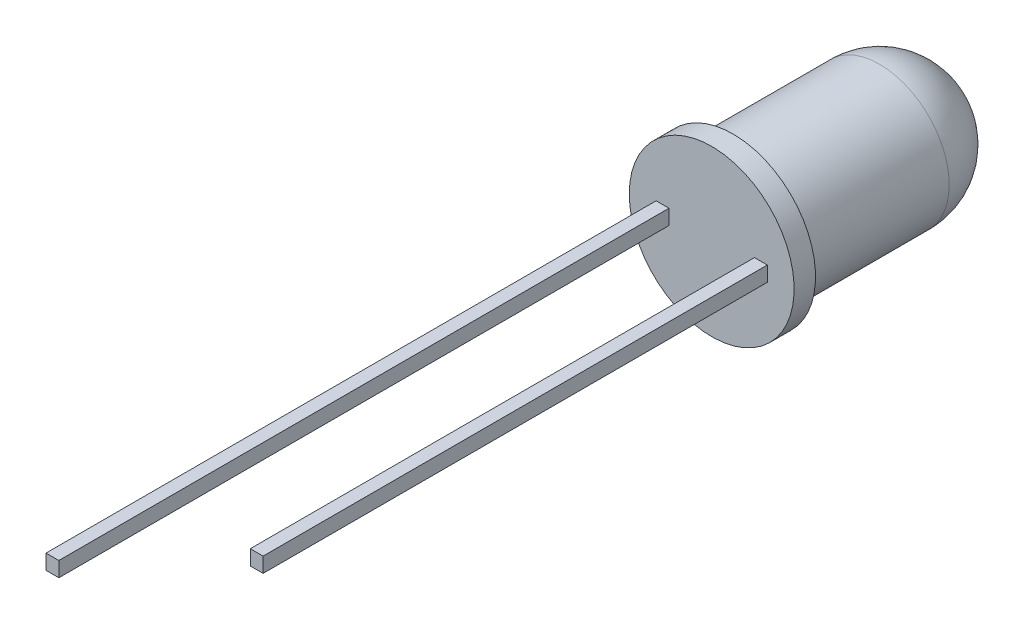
ISO-10303-21;
HEADER;
FILE_DESCRIPTION(('STEP AP214'),'2;1');
FILE_NAME('part.step','',(''),(''),'','','');
FILE_SCHEMA(('AUTOMOTIVE_DESIGN { 1 0 10303 214 1 1 1 1 }'));
ENDSEC;
DATA;
#1=APPLICATION_CONTEXT('core data for automotive mechanical design processes');
#2=APPLICATION_PROTOCOL_DEFINITION('international standard','automotive_design',2000,#1);
#3=PRODUCT_CONTEXT('',#1,'mechanical');
#4=PRODUCT('Part','Part','',(#3));
#5=PRODUCT_RELATED_PRODUCT_CATEGORY('part','',(#4));
#6=PRODUCT_DEFINITION_FORMATION('','',#4);
#7=PRODUCT_DEFINITION_CONTEXT('part definition',#1,'design');
#8=PRODUCT_DEFINITION('design','',#6,#7);
#9=PRODUCT_DEFINITION_SHAPE('','',#8);
#10=(LENGTH_UNIT() NAMED_UNIT(*) SI_UNIT(.MILLI.,.METRE.));
#11=(NAMED_UNIT(*) PLANE_ANGLE_UNIT() SI_UNIT($,.RADIAN.));
#12=(NAMED_UNIT(*) SI_UNIT($,.STERADIAN.) SOLID_ANGLE_UNIT());
#13=UNCERTAINTY_MEASURE_WITH_UNIT(LENGTH_MEASURE(1.E-05),#10,'distance_accuracy_value','');
#14=(GEOMETRIC_REPRESENTATION_CONTEXT(3) GLOBAL_UNCERTAINTY_ASSIGNED_CONTEXT((#13)) GLOBAL_UNIT_ASSIGNED_CONTEXT((#10,
#11,#12)) REPRESENTATION_CONTEXT('',''));
#15=CARTESIAN_POINT('',(0.,0.,0.));
#16=DIRECTION('',(0.,0.,1.));
#17=DIRECTION('',(1.,0.,0.));
#18=AXIS2_PLACEMENT_3D('',#15,#16,#17);
#19=CARTESIAN_POINT('',(1.995,0.,-28.5));
#20=DIRECTION('',(0.,0.,-1.));
#21=DIRECTION('',(-1.,0.,0.));
#22=AXIS2_PLACEMENT_3D('',#19,#20,#21);
#23=PLANE('',#22);
#24=CARTESIAN_POINT('',(1.995,0.,-28.5));
#25=DIRECTION('',(0.,0.,-1.));
#26=DIRECTION('',(-1.,0.,0.));
#27=AXIS2_PLACEMENT_3D('',#24,#25,#26);
#28=CIRCLE('',#27,3.85);
#29=CARTESIAN_POINT('',(-1.855,0.,-28.5));
#30=VERTEX_POINT('',#29);
#31=EDGE_CURVE('E11',#30,#30,#28,.T.);
#32=ORIENTED_EDGE('',*,*,#31,.F.);
#33=EDGE_LOOP('',(#32));
#34=FACE_BOUND('',#33,.T.);
#35=ADVANCED_FACE('F45',(#34),#23,.F.);
#36=CARTESIAN_POINT('',(1.995,0.,-38.6424057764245));
#37=DIRECTION('',(0.,0.,-1.));
#38=DIRECTION('',(-1.,0.,0.));
#39=AXIS2_PLACEMENT_3D('',#36,#37,#38);
#40=CYLINDRICAL_SURFACE('',#39,3.85);
#41=CARTESIAN_POINT('',(1.995,0.,-29.5));
#42=DIRECTION('',(0.,0.,-1.));
#43=DIRECTION('',(-1.,0.,0.));
#44=AXIS2_PLACEMENT_3D('',#41,#42,#43);
#45=CIRCLE('',#44,3.85);
#46=CARTESIAN_POINT('',(-1.855,0.,-29.5));
#47=VERTEX_POINT('',#46);
#48=EDGE_CURVE('E51',#47,#47,#45,.T.);
#49=ORIENTED_EDGE('',*,*,#48,.F.);
#50=EDGE_LOOP('',(#49));
#51=FACE_BOUND('',#50,.T.);
#52=ORIENTED_EDGE('',*,*,#31,.T.);
#53=EDGE_LOOP('',(#52));
#54=FACE_BOUND('',#53,.T.);
#55=ADVANCED_FACE('F75',(#51,#54),#40,.T.);
#56=CARTESIAN_POINT('',(5.845,0.,-29.5));
#57=DIRECTION('',(0.,0.,1.));
#58=DIRECTION('',(1.,0.,0.));
#59=AXIS2_PLACEMENT_3D('',#56,#57,#58);
#60=PLANE('',#59);
#61=CARTESIAN_POINT('',(1.995,0.,-29.5));
#62=DIRECTION('',(0.,0.,-1.));
#63=DIRECTION('',(-1.,0.,0.));
#64=AXIS2_PLACEMENT_3D('',#61,#62,#63);
#65=CIRCLE('',#64,3.25);
#66=CARTESIAN_POINT('',(-1.255,0.,-29.5));
#67=VERTEX_POINT('',#66);
#68=EDGE_CURVE('E55',#67,#67,#65,.T.);
#69=ORIENTED_EDGE('',*,*,#68,.F.);
#70=EDGE_LOOP('',(#69));
#71=FACE_BOUND('',#70,.T.);
#72=ORIENTED_EDGE('',*,*,#48,.T.);
#73=EDGE_LOOP('',(#72));
#74=FACE_BOUND('',#73,.T.);
#75=ADVANCED_FACE('F70',(#71,#74),#60,.F.);
#76=CARTESIAN_POINT('',(1.995,0.,-38.6424057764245));
#77=DIRECTION('',(0.,0.,-1.));
#78=DIRECTION('',(-1.,0.,0.));
#79=AXIS2_PLACEMENT_3D('',#76,#77,#78);
#80=CYLINDRICAL_SURFACE('',#79,3.25);
#81=CARTESIAN_POINT('',(1.995,0.,-36.3441984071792));
#82=DIRECTION('',(0.,0.,-1.));
#83=DIRECTION('',(-1.,0.,0.));
#84=AXIS2_PLACEMENT_3D('',#81,#82,#83);
#85=CIRCLE('',#84,3.25);
#86=CARTESIAN_POINT('',(-1.255,0.,-36.3441984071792));
#87=VERTEX_POINT('',#86);
#88=EDGE_CURVE('E59',#87,#87,#85,.T.);
#89=ORIENTED_EDGE('',*,*,#88,.F.);
#90=EDGE_LOOP('',(#89));
#91=FACE_BOUND('',#90,.T.);
#92=ORIENTED_EDGE('',*,*,#68,.T.);
#93=EDGE_LOOP('',(#92));
#94=FACE_BOUND('',#93,.T.);
#95=ADVANCED_FACE('F67',(#91,#94),#80,.T.);
#96=CARTESIAN_POINT('',(1.995,0.,-36.3441984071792));
#97=DIRECTION('',(0.,0.,-1.));
#98=DIRECTION('',(1.,0.,0.));
#99=AXIS2_PLACEMENT_3D('',#96,#97,#98);
#100=SPHERICAL_SURFACE('',#99,3.25);
#101=ORIENTED_EDGE('',*,*,#88,.T.);
#102=EDGE_LOOP('',(#101));
#103=FACE_BOUND('',#102,.T.);
#104=ADVANCED_FACE('F65',(#103),#100,.T.);
#105=CLOSED_SHELL('',(#35,#55,#75,#95,#104));
#106=MANIFOLD_SOLID_BREP('B2',#105);
#107=CARTESIAN_POINT('',(4.59355542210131,0.35,-32.));
#108=DIRECTION('',(0.,0.,1.));
#109=DIRECTION('',(1.,0.,0.));
#110=AXIS2_PLACEMENT_3D('',#107,#108,#109);
#111=PLANE('',#110);
#112=DIRECTION('',(-1.,0.,0.));
#113=VECTOR('',#112,1.);
#114=CARTESIAN_POINT('',(4.59355542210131,-0.35,-32.));
#115=LINE('',#114,#113);
#116=CARTESIAN_POINT('',(4.59355542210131,-0.35,-32.));
#117=VERTEX_POINT('',#116);
#118=CARTESIAN_POINT('',(0.263788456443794,-0.35,-32.));
#119=VERTEX_POINT('',#118);
#120=EDGE_CURVE('E214',#117,#119,#115,.T.);
#121=ORIENTED_EDGE('',*,*,#120,.T.);
#122=DIRECTION('',(0.,-1.,0.));
#123=VECTOR('',#122,1.);
#124=CARTESIAN_POINT('',(0.263788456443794,0.35,-32.));
#125=LINE('',#124,#123);
#126=CARTESIAN_POINT('',(0.263788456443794,0.35,-32.));
#127=VERTEX_POINT('',#126);
#128=EDGE_CURVE('E43',#127,#119,#125,.T.);
#129=ORIENTED_EDGE('',*,*,#128,.F.);
#130=DIRECTION('',(-1.,0.,0.));
#131=VECTOR('',#130,1.);
#132=CARTESIAN_POINT('',(4.59355542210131,0.35,-32.));
#133=LINE('',#132,#131);
#134=CARTESIAN_POINT('',(4.59355542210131,0.35,-32.));
#135=VERTEX_POINT('',#134);
#136=EDGE_CURVE('E226',#135,#127,#133,.T.);
#137=ORIENTED_EDGE('',*,*,#136,.F.);
#138=DIRECTION('',(0.,-1.,0.));
#139=VECTOR('',#138,1.);
#140=CARTESIAN_POINT('',(4.59355542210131,0.35,-32.));
#141=LINE('',#140,#139);
#142=EDGE_CURVE('E210',#135,#117,#141,.T.);
#143=ORIENTED_EDGE('',*,*,#142,.T.);
#144=EDGE_LOOP('',(#121,#129,#137,#143));
#145=FACE_BOUND('',#144,.T.);
#146=ADVANCED_FACE('F124',(#145),#111,.F.);
#147=CARTESIAN_POINT('',(0.263788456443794,0.35,-32.));
#148=DIRECTION('',(1.,0.,0.));
#149=DIRECTION('',(0.,0.,-1.));
#150=AXIS2_PLACEMENT_3D('',#147,#148,#149);
#151=PLANE('',#150);
#152=DIRECTION('',(0.,0.,1.));
#153=VECTOR('',#152,1.);
#154=CARTESIAN_POINT('',(0.263788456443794,-0.35,-32.));
#155=LINE('',#154,#153);
#156=CARTESIAN_POINT('',(0.263788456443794,-0.35,-31.8633656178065));
#157=VERTEX_POINT('',#156);
#158=EDGE_CURVE('E217',#119,#157,#155,.T.);
#159=ORIENTED_EDGE('',*,*,#158,.T.);
#160=DIRECTION('',(0.,-1.,0.));
#161=VECTOR('',#160,1.);
#162=CARTESIAN_POINT('',(0.263788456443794,0.35,-31.8633656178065));
#163=LINE('',#162,#161);
#164=CARTESIAN_POINT('',(0.263788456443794,0.35,-31.8633656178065));
#165=VERTEX_POINT('',#164);
#166=EDGE_CURVE('E132',#165,#157,#163,.T.);
#167=ORIENTED_EDGE('',*,*,#166,.F.);
#168=DIRECTION('',(0.,0.,1.));
#169=VECTOR('',#168,1.);
#170=CARTESIAN_POINT('',(0.263788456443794,0.35,-32.));
#171=LINE('',#170,#169);
#172=EDGE_CURVE('E180',#127,#165,#171,.T.);
#173=ORIENTED_EDGE('',*,*,#172,.F.);
#174=ORIENTED_EDGE('',*,*,#128,.T.);
#175=EDGE_LOOP('',(#159,#167,#173,#174));
#176=FACE_BOUND('',#175,.T.);
#177=ADVANCED_FACE('F251',(#176),#151,.F.);
#178=CARTESIAN_POINT('',(0.263788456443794,0.35,-31.8633656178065));
#179=DIRECTION('',(0.707106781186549,0.,-0.707106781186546));
#180=DIRECTION('',(-0.707106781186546,0.,-0.707106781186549));
#181=AXIS2_PLACEMENT_3D('',#178,#179,#180);
#182=PLANE('',#181);
#183=DIRECTION('',(0.707106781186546,0.,0.707106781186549));
#184=VECTOR('',#183,1.);
#185=CARTESIAN_POINT('',(0.263788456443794,-0.35,-31.8633656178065));
#186=LINE('',#185,#184);
#187=CARTESIAN_POINT('',(2.12715407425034,-0.35,-30.));
#188=VERTEX_POINT('',#187);
#189=EDGE_CURVE('E219',#157,#188,#186,.T.);
#190=ORIENTED_EDGE('',*,*,#189,.T.);
#191=DIRECTION('',(0.,-1.,0.));
#192=VECTOR('',#191,1.);
#193=CARTESIAN_POINT('',(2.12715407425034,0.35,-30.));
#194=LINE('',#193,#192);
#195=CARTESIAN_POINT('',(2.12715407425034,0.35,-30.));
#196=VERTEX_POINT('',#195);
#197=EDGE_CURVE('E230',#196,#188,#194,.T.);
#198=ORIENTED_EDGE('',*,*,#197,.F.);
#199=DIRECTION('',(0.707106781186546,0.,0.707106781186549));
#200=VECTOR('',#199,1.);
#201=CARTESIAN_POINT('',(0.263788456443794,0.35,-31.8633656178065));
#202=LINE('',#201,#200);
#203=EDGE_CURVE('E238',#165,#196,#202,.T.);
#204=ORIENTED_EDGE('',*,*,#203,.F.);
#205=ORIENTED_EDGE('',*,*,#166,.T.);
#206=EDGE_LOOP('',(#190,#198,#204,#205));
#207=FACE_BOUND('',#206,.T.);
#208=ADVANCED_FACE('F236',(#207),#182,.F.);
#209=CARTESIAN_POINT('',(2.12715407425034,0.35,-30.));
#210=DIRECTION('',(0.,0.,-1.));
#211=DIRECTION('',(-1.,0.,0.));
#212=AXIS2_PLACEMENT_3D('',#209,#210,#211);
#213=PLANE('',#212);
#214=DIRECTION('',(1.,0.,0.));
#215=VECTOR('',#214,1.);
#216=CARTESIAN_POINT('',(2.12715407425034,-0.35,-30.));
#217=LINE('',#216,#215);
#218=CARTESIAN_POINT('',(3.99355542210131,-0.35,-30.));
#219=VERTEX_POINT('',#218);
#220=EDGE_CURVE('E221',#188,#219,#217,.T.);
#221=ORIENTED_EDGE('',*,*,#220,.T.);
#222=DIRECTION('',(0.,-1.,0.));
#223=VECTOR('',#222,1.);
#224=CARTESIAN_POINT('',(3.99355542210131,0.35,-30.));
#225=LINE('',#224,#223);
#226=CARTESIAN_POINT('',(3.99355542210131,0.35,-30.));
#227=VERTEX_POINT('',#226);
#228=EDGE_CURVE('E205',#227,#219,#225,.T.);
#229=ORIENTED_EDGE('',*,*,#228,.F.);
#230=DIRECTION('',(1.,0.,0.));
#231=VECTOR('',#230,1.);
#232=CARTESIAN_POINT('',(2.12715407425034,0.35,-30.));
#233=LINE('',#232,#231);
#234=EDGE_CURVE('E196',#196,#227,#233,.T.);
#235=ORIENTED_EDGE('',*,*,#234,.F.);
#236=ORIENTED_EDGE('',*,*,#197,.T.);
#237=EDGE_LOOP('',(#221,#229,#235,#236));
#238=FACE_BOUND('',#237,.T.);
#239=ADVANCED_FACE('F244',(#238),#213,.F.);
#240=CARTESIAN_POINT('',(3.99355542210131,0.35,-30.));
#241=DIRECTION('',(1.,0.,0.));
#242=DIRECTION('',(0.,0.,-1.));
#243=AXIS2_PLACEMENT_3D('',#240,#241,#242);
#244=PLANE('',#243);
#245=DIRECTION('',(0.,0.,1.));
#246=VECTOR('',#245,1.);
#247=CARTESIAN_POINT('',(3.99355542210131,-0.35,-30.));
#248=LINE('',#247,#246);
#249=CARTESIAN_POINT('',(3.99355542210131,-0.35,-4.948502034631));
#250=VERTEX_POINT('',#249);
#251=EDGE_CURVE('E204',#219,#250,#248,.T.);
#252=ORIENTED_EDGE('',*,*,#251,.T.);
#253=DIRECTION('',(0.,-1.,0.));
#254=VECTOR('',#253,1.);
#255=CARTESIAN_POINT('',(3.99355542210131,0.35,-4.948502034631));
#256=LINE('',#255,#254);
#257=CARTESIAN_POINT('',(3.99355542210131,0.35,-4.948502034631));
#258=VERTEX_POINT('',#257);
#259=EDGE_CURVE('E201',#258,#250,#256,.T.);
#260=ORIENTED_EDGE('',*,*,#259,.F.);
#261=DIRECTION('',(0.,0.,1.));
#262=VECTOR('',#261,1.);
#263=CARTESIAN_POINT('',(3.99355542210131,0.35,-30.));
#264=LINE('',#263,#262);
#265=EDGE_CURVE('E190',#227,#258,#264,.T.);
#266=ORIENTED_EDGE('',*,*,#265,.F.);
#267=ORIENTED_EDGE('',*,*,#228,.T.);
#268=EDGE_LOOP('',(#252,#260,#266,#267));
#269=FACE_BOUND('',#268,.T.);
#270=ADVANCED_FACE('F202',(#269),#244,.F.);
#271=CARTESIAN_POINT('',(3.99355542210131,0.35,-4.948502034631));
#272=DIRECTION('',(0.,0.,-1.));
#273=DIRECTION('',(-1.,0.,0.));
#274=AXIS2_PLACEMENT_3D('',#271,#272,#273);
#275=PLANE('',#274);
#276=DIRECTION('',(1.,0.,0.));
#277=VECTOR('',#276,1.);
#278=CARTESIAN_POINT('',(3.99355542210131,-0.35,-4.948502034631));
#279=LINE('',#278,#277);
#280=CARTESIAN_POINT('',(4.59355542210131,-0.35,-4.948502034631));
#281=VERTEX_POINT('',#280);
#282=EDGE_CURVE('E166',#250,#281,#279,.T.);
#283=ORIENTED_EDGE('',*,*,#282,.T.);
#284=DIRECTION('',(0.,-1.,0.));
#285=VECTOR('',#284,1.);
#286=CARTESIAN_POINT('',(4.59355542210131,0.35,-4.948502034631));
#287=LINE('',#286,#285);
#288=CARTESIAN_POINT('',(4.59355542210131,0.35,-4.948502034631));
#289=VERTEX_POINT('',#288);
#290=EDGE_CURVE('E206',#289,#281,#287,.T.);
#291=ORIENTED_EDGE('',*,*,#290,.F.);
#292=DIRECTION('',(1.,0.,0.));
#293=VECTOR('',#292,1.);
#294=CARTESIAN_POINT('',(3.99355542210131,0.35,-4.948502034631));
#295=LINE('',#294,#293);
#296=EDGE_CURVE('E194',#258,#289,#295,.T.);
#297=ORIENTED_EDGE('',*,*,#296,.F.);
#298=ORIENTED_EDGE('',*,*,#259,.T.);
#299=EDGE_LOOP('',(#283,#291,#297,#298));
#300=FACE_BOUND('',#299,.T.);
#301=ADVANCED_FACE('F208',(#300),#275,.F.);
#302=CARTESIAN_POINT('',(4.59355542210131,0.35,-4.948502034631));
#303=DIRECTION('',(-1.,0.,0.));
#304=DIRECTION('',(0.,0.,1.));
#305=AXIS2_PLACEMENT_3D('',#302,#303,#304);
#306=PLANE('',#305);
#307=DIRECTION('',(0.,0.,-1.));
#308=VECTOR('',#307,1.);
#309=CARTESIAN_POINT('',(4.59355542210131,-0.35,-4.948502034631));
#310=LINE('',#309,#308);
#311=EDGE_CURVE('E172',#281,#117,#310,.T.);
#312=ORIENTED_EDGE('',*,*,#311,.T.);
#313=ORIENTED_EDGE('',*,*,#142,.F.);
#314=DIRECTION('',(0.,0.,-1.));
#315=VECTOR('',#314,1.);
#316=CARTESIAN_POINT('',(4.59355542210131,0.35,-4.948502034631));
#317=LINE('',#316,#315);
#318=EDGE_CURVE('E140',#289,#135,#317,.T.);
#319=ORIENTED_EDGE('',*,*,#318,.F.);
#320=ORIENTED_EDGE('',*,*,#290,.T.);
#321=EDGE_LOOP('',(#312,#313,#319,#320));
#322=FACE_BOUND('',#321,.T.);
#323=ADVANCED_FACE('F265',(#322),#306,.F.);
#324=CARTESIAN_POINT('',(0.,0.35,0.));
#325=DIRECTION('',(0.,1.,0.));
#326=DIRECTION('',(0.,0.,1.));
#327=AXIS2_PLACEMENT_3D('',#324,#325,#326);
#328=PLANE('',#327);
#329=ORIENTED_EDGE('',*,*,#136,.T.);
#330=ORIENTED_EDGE('',*,*,#172,.T.);
#331=ORIENTED_EDGE('',*,*,#203,.T.);
#332=ORIENTED_EDGE('',*,*,#234,.T.);
#333=ORIENTED_EDGE('',*,*,#265,.T.);
#334=ORIENTED_EDGE('',*,*,#296,.T.);
#335=ORIENTED_EDGE('',*,*,#318,.T.);
#336=EDGE_LOOP('',(#329,#330,#331,#332,#333,#334,#335));
#337=FACE_BOUND('',#336,.T.);
#338=ADVANCED_FACE('F192',(#337),#328,.T.);
#339=CARTESIAN_POINT('',(0.,-0.35,0.));
#340=DIRECTION('',(0.,1.,0.));
#341=DIRECTION('',(0.,0.,1.));
#342=AXIS2_PLACEMENT_3D('',#339,#340,#341);
#343=PLANE('',#342);
#344=ORIENTED_EDGE('',*,*,#120,.F.);
#345=ORIENTED_EDGE('',*,*,#311,.F.);
#346=ORIENTED_EDGE('',*,*,#282,.F.);
#347=ORIENTED_EDGE('',*,*,#251,.F.);
#348=ORIENTED_EDGE('',*,*,#220,.F.);
#349=ORIENTED_EDGE('',*,*,#189,.F.);
#350=ORIENTED_EDGE('',*,*,#158,.F.);
#351=EDGE_LOOP('',(#344,#345,#346,#347,#348,#349,#350));
#352=FACE_BOUND('',#351,.T.);
#353=ADVANCED_FACE('F242',(#352),#343,.F.);
#354=CLOSED_SHELL('',(#146,#177,#208,#239,#270,#301,#323,#338,#353));
#355=MANIFOLD_SOLID_BREP('B6',#354);
#356=CARTESIAN_POINT('',(0.,0.35,0.));
#357=DIRECTION('',(0.,0.,-1.));
#358=DIRECTION('',(-1.,0.,0.));
#359=AXIS2_PLACEMENT_3D('',#356,#357,#358);
#360=PLANE('',#359);
#361=DIRECTION('',(1.,0.,0.));
#362=VECTOR('',#361,1.);
#363=CARTESIAN_POINT('',(0.,-0.35,0.));
#364=LINE('',#363,#362);
#365=CARTESIAN_POINT('',(-0.6,-0.35,0.));
#366=VERTEX_POINT('',#365);
#367=CARTESIAN_POINT('',(0.,-0.35,0.));
#368=VERTEX_POINT('',#367);
#369=EDGE_CURVE('E427',#366,#368,#364,.T.);
#370=ORIENTED_EDGE('',*,*,#369,.T.);
#371=DIRECTION('',(0.,-1.,0.));
#372=VECTOR('',#371,1.);
#373=CARTESIAN_POINT('',(0.,0.35,0.));
#374=LINE('',#373,#372);
#375=CARTESIAN_POINT('',(0.,0.35,0.));
#376=VERTEX_POINT('',#375);
#377=EDGE_CURVE('E122',#376,#368,#374,.T.);
#378=ORIENTED_EDGE('',*,*,#377,.F.);
#379=DIRECTION('',(1.,0.,0.));
#380=VECTOR('',#379,1.);
#381=CARTESIAN_POINT('',(0.,0.35,0.));
#382=LINE('',#381,#380);
#383=CARTESIAN_POINT('',(-0.6,0.35,0.));
#384=VERTEX_POINT('',#383);
#385=EDGE_CURVE('E443',#384,#376,#382,.T.);
#386=ORIENTED_EDGE('',*,*,#385,.F.);
#387=DIRECTION('',(0.,-1.,0.));
#388=VECTOR('',#387,1.);
#389=CARTESIAN_POINT('',(-0.6,0.35,0.));
#390=LINE('',#389,#388);
#391=EDGE_CURVE('E423',#384,#366,#390,.T.);
#392=ORIENTED_EDGE('',*,*,#391,.T.);
#393=EDGE_LOOP('',(#370,#378,#386,#392));
#394=FACE_BOUND('',#393,.T.);
#395=ADVANCED_FACE('F325',(#394),#360,.F.);
#396=CARTESIAN_POINT('',(0.,0.35,-30.));
#397=DIRECTION('',(-1.,0.,0.));
#398=DIRECTION('',(0.,0.,1.));
#399=AXIS2_PLACEMENT_3D('',#396,#397,#398);
#400=PLANE('',#399);
#401=DIRECTION('',(0.,0.,-1.));
#402=VECTOR('',#401,1.);
#403=CARTESIAN_POINT('',(0.,-0.35,-30.));
#404=LINE('',#403,#402);
#405=CARTESIAN_POINT('',(0.,-0.35,-30.));
#406=VERTEX_POINT('',#405);
#407=EDGE_CURVE('E430',#368,#406,#404,.T.);
#408=ORIENTED_EDGE('',*,*,#407,.T.);
#409=DIRECTION('',(0.,-1.,0.));
#410=VECTOR('',#409,1.);
#411=CARTESIAN_POINT('',(0.,0.35,-30.));
#412=LINE('',#411,#410);
#413=CARTESIAN_POINT('',(0.,0.35,-30.));
#414=VERTEX_POINT('',#413);
#415=EDGE_CURVE('E333',#414,#406,#412,.T.);
#416=ORIENTED_EDGE('',*,*,#415,.F.);
#417=DIRECTION('',(0.,0.,-1.));
#418=VECTOR('',#417,1.);
#419=CARTESIAN_POINT('',(0.,0.35,-30.));
#420=LINE('',#419,#418);
#421=EDGE_CURVE('E387',#376,#414,#420,.T.);
#422=ORIENTED_EDGE('',*,*,#421,.F.);
#423=ORIENTED_EDGE('',*,*,#377,.T.);
#424=EDGE_LOOP('',(#408,#416,#422,#423));
#425=FACE_BOUND('',#424,.T.);
#426=ADVANCED_FACE('F486',(#425),#400,.F.);
#427=CARTESIAN_POINT('',(1.49886633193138,0.35,-30.));
#428=DIRECTION('',(0.,0.,-1.));
#429=DIRECTION('',(-1.,0.,0.));
#430=AXIS2_PLACEMENT_3D('',#427,#428,#429);
#431=PLANE('',#430);
#432=DIRECTION('',(1.,0.,0.));
#433=VECTOR('',#432,1.);
#434=CARTESIAN_POINT('',(1.49886633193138,-0.35,-30.));
#435=LINE('',#434,#433);
#436=CARTESIAN_POINT('',(1.49886633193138,-0.35,-30.));
#437=VERTEX_POINT('',#436);
#438=EDGE_CURVE('E432',#406,#437,#435,.T.);
#439=ORIENTED_EDGE('',*,*,#438,.T.);
#440=DIRECTION('',(0.,-1.,0.));
#441=VECTOR('',#440,1.);
#442=CARTESIAN_POINT('',(1.49886633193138,0.35,-30.));
#443=LINE('',#442,#441);
#444=CARTESIAN_POINT('',(1.49886633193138,0.35,-30.));
#445=VERTEX_POINT('',#444);
#446=EDGE_CURVE('E453',#445,#437,#443,.T.);
#447=ORIENTED_EDGE('',*,*,#446,.F.);
#448=DIRECTION('',(1.,0.,0.));
#449=VECTOR('',#448,1.);
#450=CARTESIAN_POINT('',(1.49886633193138,0.35,-30.));
#451=LINE('',#450,#449);
#452=EDGE_CURVE('E461',#414,#445,#451,.T.);
#453=ORIENTED_EDGE('',*,*,#452,.F.);
#454=ORIENTED_EDGE('',*,*,#415,.T.);
#455=EDGE_LOOP('',(#439,#447,#453,#454));
#456=FACE_BOUND('',#455,.T.);
#457=ADVANCED_FACE('F459',(#456),#431,.F.);
#458=CARTESIAN_POINT('',(-0.364499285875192,0.35,-31.8633656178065));
#459=DIRECTION('',(-0.707106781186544,0.,0.707106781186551));
#460=DIRECTION('',(0.707106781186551,0.,0.707106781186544));
#461=AXIS2_PLACEMENT_3D('',#458,#459,#460);
#462=PLANE('',#461);
#463=DIRECTION('',(-0.707106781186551,0.,-0.707106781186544));
#464=VECTOR('',#463,1.);
#465=CARTESIAN_POINT('',(-0.364499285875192,-0.35,-31.8633656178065));
#466=LINE('',#465,#464);
#467=CARTESIAN_POINT('',(-0.364499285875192,-0.35,-31.8633656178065));
#468=VERTEX_POINT('',#467);
#469=EDGE_CURVE('E434',#437,#468,#466,.T.);
#470=ORIENTED_EDGE('',*,*,#469,.T.);
#471=DIRECTION('',(0.,-1.,0.));
#472=VECTOR('',#471,1.);
#473=CARTESIAN_POINT('',(-0.364499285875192,0.35,-31.8633656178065));
#474=LINE('',#473,#472);
#475=CARTESIAN_POINT('',(-0.364499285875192,0.35,-31.8633656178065));
#476=VERTEX_POINT('',#475);
#477=EDGE_CURVE('E450',#476,#468,#474,.T.);
#478=ORIENTED_EDGE('',*,*,#477,.F.);
#479=DIRECTION('',(-0.707106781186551,0.,-0.707106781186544));
#480=VECTOR('',#479,1.);
#481=CARTESIAN_POINT('',(-0.364499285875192,0.35,-31.8633656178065));
#482=LINE('',#481,#480);
#483=EDGE_CURVE('E477',#445,#476,#482,.T.);
#484=ORIENTED_EDGE('',*,*,#483,.F.);
#485=ORIENTED_EDGE('',*,*,#446,.T.);
#486=EDGE_LOOP('',(#470,#478,#484,#485));
#487=FACE_BOUND('',#486,.T.);
#488=ADVANCED_FACE('F470',(#487),#462,.F.);
#489=CARTESIAN_POINT('',(-0.364499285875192,0.35,-31.8633656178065));
#490=DIRECTION('',(-1.,0.,0.));
#491=DIRECTION('',(0.,0.,1.));
#492=AXIS2_PLACEMENT_3D('',#489,#490,#491);
#493=PLANE('',#492);
#494=DIRECTION('',(0.,0.,-1.));
#495=VECTOR('',#494,1.);
#496=CARTESIAN_POINT('',(-0.364499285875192,-0.35,-31.8633656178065));
#497=LINE('',#496,#495);
#498=CARTESIAN_POINT('',(-0.364499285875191,-0.35,-32.));
#499=VERTEX_POINT('',#498);
#500=EDGE_CURVE('E436',#468,#499,#497,.T.);
#501=ORIENTED_EDGE('',*,*,#500,.T.);
#502=DIRECTION('',(0.,-1.,0.));
#503=VECTOR('',#502,1.);
#504=CARTESIAN_POINT('',(-0.364499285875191,0.35,-32.));
#505=LINE('',#504,#503);
#506=CARTESIAN_POINT('',(-0.364499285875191,0.35,-32.));
#507=VERTEX_POINT('',#506);
#508=EDGE_CURVE('E447',#507,#499,#505,.T.);
#509=ORIENTED_EDGE('',*,*,#508,.F.);
#510=DIRECTION('',(0.,0.,-1.));
#511=VECTOR('',#510,1.);
#512=CARTESIAN_POINT('',(-0.364499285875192,0.35,-31.8633656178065));
#513=LINE('',#512,#511);
#514=EDGE_CURVE('E476',#476,#507,#513,.T.);
#515=ORIENTED_EDGE('',*,*,#514,.F.);
#516=ORIENTED_EDGE('',*,*,#477,.T.);
#517=EDGE_LOOP('',(#501,#509,#515,#516));
#518=FACE_BOUND('',#517,.T.);
#519=ADVANCED_FACE('F474',(#518),#493,.F.);
#520=CARTESIAN_POINT('',(-0.364499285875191,0.35,-32.));
#521=DIRECTION('',(0.,0.,1.));
#522=DIRECTION('',(1.,0.,0.));
#523=AXIS2_PLACEMENT_3D('',#520,#521,#522);
#524=PLANE('',#523);
#525=DIRECTION('',(-1.,0.,0.));
#526=VECTOR('',#525,1.);
#527=CARTESIAN_POINT('',(-0.364499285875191,-0.35,-32.));
#528=LINE('',#527,#526);
#529=CARTESIAN_POINT('',(-0.921269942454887,-0.35,-32.));
#530=VERTEX_POINT('',#529);
#531=EDGE_CURVE('E438',#499,#530,#528,.T.);
#532=ORIENTED_EDGE('',*,*,#531,.T.);
#533=DIRECTION('',(0.,-1.,0.));
#534=VECTOR('',#533,1.);
#535=CARTESIAN_POINT('',(-0.921269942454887,0.35,-32.));
#536=LINE('',#535,#534);
#537=CARTESIAN_POINT('',(-0.921269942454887,0.35,-32.));
#538=VERTEX_POINT('',#537);
#539=EDGE_CURVE('E418',#538,#530,#536,.T.);
#540=ORIENTED_EDGE('',*,*,#539,.F.);
#541=DIRECTION('',(-1.,0.,0.));
#542=VECTOR('',#541,1.);
#543=CARTESIAN_POINT('',(-0.364499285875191,0.35,-32.));
#544=LINE('',#543,#542);
#545=EDGE_CURVE('E409',#507,#538,#544,.T.);
#546=ORIENTED_EDGE('',*,*,#545,.F.);
#547=ORIENTED_EDGE('',*,*,#508,.T.);
#548=EDGE_LOOP('',(#532,#540,#546,#547));
#549=FACE_BOUND('',#548,.T.);
#550=ADVANCED_FACE('F498',(#549),#524,.F.);
#551=CARTESIAN_POINT('',(-0.921269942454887,0.35,-30.));
#552=DIRECTION('',(1.,0.,0.));
#553=DIRECTION('',(0.,0.,-1.));
#554=AXIS2_PLACEMENT_3D('',#551,#552,#553);
#555=PLANE('',#554);
#556=DIRECTION('',(0.,0.,1.));
#557=VECTOR('',#556,1.);
#558=CARTESIAN_POINT('',(-0.921269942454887,-0.35,-30.));
#559=LINE('',#558,#557);
#560=CARTESIAN_POINT('',(-0.921269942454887,-0.35,-30.));
#561=VERTEX_POINT('',#560);
#562=EDGE_CURVE('E417',#530,#561,#559,.T.);
#563=ORIENTED_EDGE('',*,*,#562,.T.);
#564=DIRECTION('',(0.,-1.,0.));
#565=VECTOR('',#564,1.);
#566=CARTESIAN_POINT('',(-0.921269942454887,0.35,-30.));
#567=LINE('',#566,#565);
#568=CARTESIAN_POINT('',(-0.921269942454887,0.35,-30.));
#569=VERTEX_POINT('',#568);
#570=EDGE_CURVE('E414',#569,#561,#567,.T.);
#571=ORIENTED_EDGE('',*,*,#570,.F.);
#572=DIRECTION('',(0.,0.,1.));
#573=VECTOR('',#572,1.);
#574=CARTESIAN_POINT('',(-0.921269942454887,0.35,-30.));
#575=LINE('',#574,#573);
#576=EDGE_CURVE('E403',#538,#569,#575,.T.);
#577=ORIENTED_EDGE('',*,*,#576,.F.);
#578=ORIENTED_EDGE('',*,*,#539,.T.);
#579=EDGE_LOOP('',(#563,#571,#577,#578));
#580=FACE_BOUND('',#579,.T.);
#581=ADVANCED_FACE('F415',(#580),#555,.F.);
#582=CARTESIAN_POINT('',(-0.6,0.35,-30.));
#583=DIRECTION('',(0.,0.,-1.));
#584=DIRECTION('',(-1.,0.,0.));
#585=AXIS2_PLACEMENT_3D('',#582,#583,#584);
#586=PLANE('',#585);
#587=DIRECTION('',(1.,0.,0.));
#588=VECTOR('',#587,1.);
#589=CARTESIAN_POINT('',(-0.6,-0.35,-30.));
#590=LINE('',#589,#588);
#591=CARTESIAN_POINT('',(-0.6,-0.35,-30.));
#592=VERTEX_POINT('',#591);
#593=EDGE_CURVE('E373',#561,#592,#590,.T.);
#594=ORIENTED_EDGE('',*,*,#593,.T.);
#595=DIRECTION('',(0.,-1.,0.));
#596=VECTOR('',#595,1.);
#597=CARTESIAN_POINT('',(-0.6,0.35,-30.));
#598=LINE('',#597,#596);
#599=CARTESIAN_POINT('',(-0.6,0.35,-30.));
#600=VERTEX_POINT('',#599);
#601=EDGE_CURVE('E419',#600,#592,#598,.T.);
#602=ORIENTED_EDGE('',*,*,#601,.F.);
#603=DIRECTION('',(1.,0.,0.));
#604=VECTOR('',#603,1.);
#605=CARTESIAN_POINT('',(-0.6,0.35,-30.));
#606=LINE('',#605,#604);
#607=EDGE_CURVE('E407',#569,#600,#606,.T.);
#608=ORIENTED_EDGE('',*,*,#607,.F.);
#609=ORIENTED_EDGE('',*,*,#570,.T.);
#610=EDGE_LOOP('',(#594,#602,#608,#609));
#611=FACE_BOUND('',#610,.T.);
#612=ADVANCED_FACE('F421',(#611),#586,.F.);
#613=CARTESIAN_POINT('',(-0.6,0.35,0.));
#614=DIRECTION('',(1.,0.,0.));
#615=DIRECTION('',(0.,0.,-1.));
#616=AXIS2_PLACEMENT_3D('',#613,#614,#615);
#617=PLANE('',#616);
#618=DIRECTION('',(0.,0.,1.));
#619=VECTOR('',#618,1.);
#620=CARTESIAN_POINT('',(-0.6,-0.35,0.));
#621=LINE('',#620,#619);
#622=EDGE_CURVE('E379',#592,#366,#621,.T.);
#623=ORIENTED_EDGE('',*,*,#622,.T.);
#624=ORIENTED_EDGE('',*,*,#391,.F.);
#625=DIRECTION('',(0.,0.,1.));
#626=VECTOR('',#625,1.);
#627=CARTESIAN_POINT('',(-0.6,0.35,0.));
#628=LINE('',#627,#626);
#629=EDGE_CURVE('E341',#600,#384,#628,.T.);
#630=ORIENTED_EDGE('',*,*,#629,.F.);
#631=ORIENTED_EDGE('',*,*,#601,.T.);
#632=EDGE_LOOP('',(#623,#624,#630,#631));
#633=FACE_BOUND('',#632,.T.);
#634=ADVANCED_FACE('F506',(#633),#617,.F.);
#635=CARTESIAN_POINT('',(0.,0.35,0.));
#636=DIRECTION('',(0.,-1.,0.));
#637=DIRECTION('',(0.,0.,-1.));
#638=AXIS2_PLACEMENT_3D('',#635,#636,#637);
#639=PLANE('',#638);
#640=ORIENTED_EDGE('',*,*,#385,.T.);
#641=ORIENTED_EDGE('',*,*,#421,.T.);
#642=ORIENTED_EDGE('',*,*,#452,.T.);
#643=ORIENTED_EDGE('',*,*,#483,.T.);
#644=ORIENTED_EDGE('',*,*,#514,.T.);
#645=ORIENTED_EDGE('',*,*,#545,.T.);
#646=ORIENTED_EDGE('',*,*,#576,.T.);
#647=ORIENTED_EDGE('',*,*,#607,.T.);
#648=ORIENTED_EDGE('',*,*,#629,.T.);
#649=EDGE_LOOP('',(#640,#641,#642,#643,#644,#645,#646,#647,#648));
#650=FACE_BOUND('',#649,.T.);
#651=ADVANCED_FACE('F405',(#650),#639,.F.);
#652=CARTESIAN_POINT('',(0.,-0.35,0.));
#653=DIRECTION('',(0.,-1.,0.));
#654=DIRECTION('',(0.,0.,-1.));
#655=AXIS2_PLACEMENT_3D('',#652,#653,#654);
#656=PLANE('',#655);
#657=ORIENTED_EDGE('',*,*,#369,.F.);
#658=ORIENTED_EDGE('',*,*,#622,.F.);
#659=ORIENTED_EDGE('',*,*,#593,.F.);
#660=ORIENTED_EDGE('',*,*,#562,.F.);
#661=ORIENTED_EDGE('',*,*,#531,.F.);
#662=ORIENTED_EDGE('',*,*,#500,.F.);
#663=ORIENTED_EDGE('',*,*,#469,.F.);
#664=ORIENTED_EDGE('',*,*,#438,.F.);
#665=ORIENTED_EDGE('',*,*,#407,.F.);
#666=EDGE_LOOP('',(#657,#658,#659,#660,#661,#662,#663,#664,#665));
#667=FACE_BOUND('',#666,.T.);
#668=ADVANCED_FACE('F465',(#667),#656,.T.);
#669=CLOSED_SHELL('',(#395,#426,#457,#488,#519,#550,#581,#612,#634,#651,#668));
#670=MANIFOLD_SOLID_BREP('B37',#669);
#671=ADVANCED_BREP_SHAPE_REPRESENTATION('',(#18,#106,#355,#670),#14);
#672=SHAPE_DEFINITION_REPRESENTATION(#9,#671);
ENDSEC;
END-ISO-10303-21;
